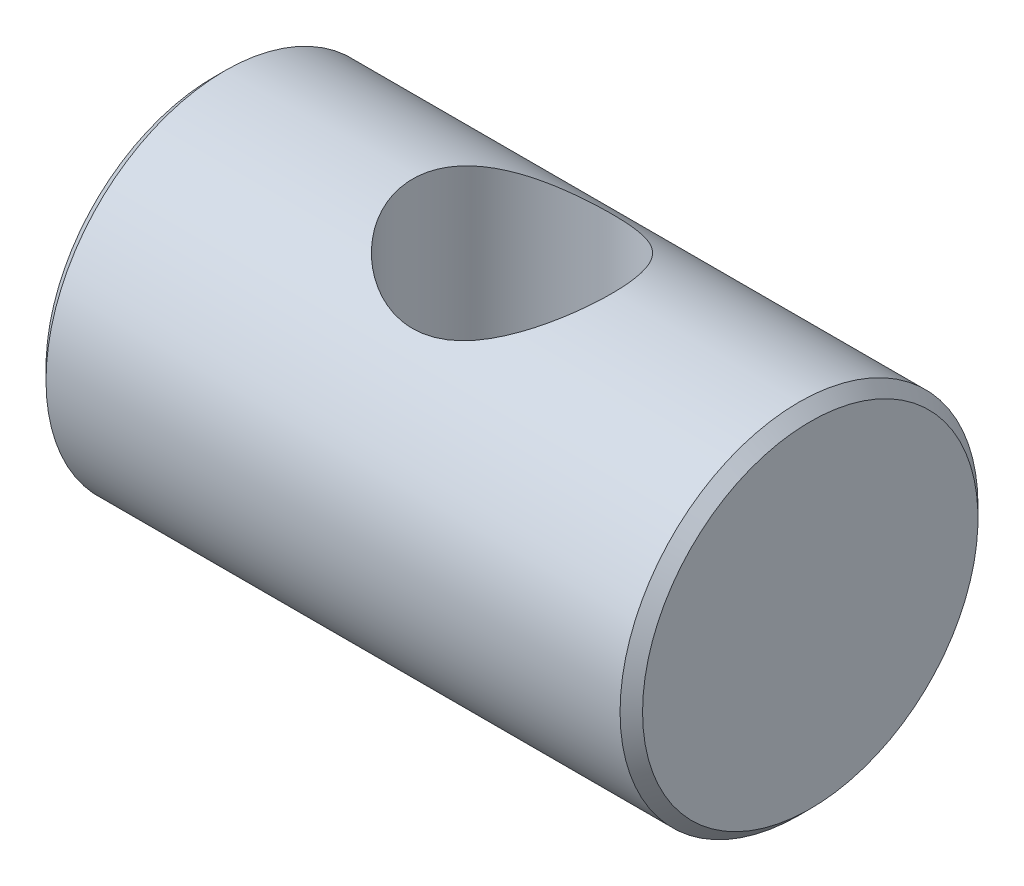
ISO-10303-21;
HEADER;
FILE_DESCRIPTION(('STEP AP214'),'2;1');
FILE_NAME('part.step','',(''),(''),'','','');
FILE_SCHEMA(('AUTOMOTIVE_DESIGN { 1 0 10303 214 1 1 1 1 }'));
ENDSEC;
DATA;
#1=APPLICATION_CONTEXT('core data for automotive mechanical design processes');
#2=APPLICATION_PROTOCOL_DEFINITION('international standard','automotive_design',2000,#1);
#3=PRODUCT_CONTEXT('',#1,'mechanical');
#4=PRODUCT('Part','Part','',(#3));
#5=PRODUCT_RELATED_PRODUCT_CATEGORY('part','',(#4));
#6=PRODUCT_DEFINITION_FORMATION('','',#4);
#7=PRODUCT_DEFINITION_CONTEXT('part definition',#1,'design');
#8=PRODUCT_DEFINITION('design','',#6,#7);
#9=PRODUCT_DEFINITION_SHAPE('','',#8);
#10=(LENGTH_UNIT() NAMED_UNIT(*) SI_UNIT(.MILLI.,.METRE.));
#11=(NAMED_UNIT(*) PLANE_ANGLE_UNIT() SI_UNIT($,.RADIAN.));
#12=(NAMED_UNIT(*) SI_UNIT($,.STERADIAN.) SOLID_ANGLE_UNIT());
#13=UNCERTAINTY_MEASURE_WITH_UNIT(LENGTH_MEASURE(1.E-05),#10,'distance_accuracy_value','');
#14=(GEOMETRIC_REPRESENTATION_CONTEXT(3) GLOBAL_UNCERTAINTY_ASSIGNED_CONTEXT((#13)) GLOBAL_UNIT_ASSIGNED_CONTEXT((#10,
#11,#12)) REPRESENTATION_CONTEXT('',''));
#15=CARTESIAN_POINT('',(0.,0.,0.));
#16=DIRECTION('',(0.,0.,1.));
#17=DIRECTION('',(1.,0.,0.));
#18=AXIS2_PLACEMENT_3D('',#15,#16,#17);
#19=CARTESIAN_POINT('',(7.5,4.21715728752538,0.));
#20=DIRECTION('',(-1.,0.,0.));
#21=DIRECTION('',(0.,0.,1.));
#22=AXIS2_PLACEMENT_3D('',#19,#20,#21);
#23=PLANE('',#22);
#24=CARTESIAN_POINT('',(7.49999999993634,0.,0.));
#25=DIRECTION('',(-1.,0.,0.));
#26=DIRECTION('',(0.,0.,1.));
#27=AXIS2_PLACEMENT_3D('',#24,#25,#26);
#28=CIRCLE('',#27,4.2171572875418);
#29=CARTESIAN_POINT('',(7.49999999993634,0.,4.2171572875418));
#30=VERTEX_POINT('',#29);
#31=EDGE_CURVE('E43',#30,#30,#28,.T.);
#32=ORIENTED_EDGE('',*,*,#31,.F.);
#33=EDGE_LOOP('',(#32));
#34=FACE_BOUND('',#33,.T.);
#35=ADVANCED_FACE('F12',(#34),#23,.F.);
#36=CARTESIAN_POINT('',(-7.5,0.,0.));
#37=DIRECTION('',(1.,0.,0.));
#38=DIRECTION('',(0.,0.,-1.));
#39=AXIS2_PLACEMENT_3D('',#36,#37,#38);
#40=PLANE('',#39);
#41=CARTESIAN_POINT('',(-7.49999999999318,0.,0.));
#42=DIRECTION('',(1.,0.,0.));
#43=DIRECTION('',(0.,0.,-1.));
#44=AXIS2_PLACEMENT_3D('',#41,#42,#43);
#45=CIRCLE('',#44,4.2171572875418);
#46=CARTESIAN_POINT('',(-7.49999999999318,0.,-4.2171572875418));
#47=VERTEX_POINT('',#46);
#48=EDGE_CURVE('E70',#47,#47,#45,.T.);
#49=ORIENTED_EDGE('',*,*,#48,.F.);
#50=EDGE_LOOP('',(#49));
#51=FACE_BOUND('',#50,.T.);
#52=ADVANCED_FACE('F59',(#51),#40,.F.);
#53=CARTESIAN_POINT('',(7.2171572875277,0.,0.));
#54=DIRECTION('',(-1.,0.,0.));
#55=DIRECTION('',(0.,0.,1.));
#56=AXIS2_PLACEMENT_3D('',#53,#54,#55);
#57=CONICAL_SURFACE('',#56,4.49999999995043,0.785398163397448);
#58=CARTESIAN_POINT('',(7.21715728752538,0.,0.));
#59=DIRECTION('',(1.,0.,0.));
#60=DIRECTION('',(0.,0.,-1.));
#61=AXIS2_PLACEMENT_3D('',#58,#59,#60);
#62=CIRCLE('',#61,4.5);
#63=CARTESIAN_POINT('',(7.21715728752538,0.,-4.5));
#64=VERTEX_POINT('',#63);
#65=EDGE_CURVE('E37',#64,#64,#62,.F.);
#66=ORIENTED_EDGE('',*,*,#65,.F.);
#67=EDGE_LOOP('',(#66));
#68=FACE_BOUND('',#67,.T.);
#69=ORIENTED_EDGE('',*,*,#31,.T.);
#70=EDGE_LOOP('',(#69));
#71=FACE_BOUND('',#70,.T.);
#72=ADVANCED_FACE('F64',(#68,#71),#57,.T.);
#73=CARTESIAN_POINT('',(-7.21715728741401,0.,0.));
#74=DIRECTION('',(1.,0.,0.));
#75=DIRECTION('',(0.,0.,-1.));
#76=AXIS2_PLACEMENT_3D('',#73,#74,#75);
#77=CONICAL_SURFACE('',#76,4.50000000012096,0.785398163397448);
#78=ORIENTED_EDGE('',*,*,#48,.T.);
#79=EDGE_LOOP('',(#78));
#80=FACE_BOUND('',#79,.T.);
#81=CARTESIAN_POINT('',(-7.21715728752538,0.,0.));
#82=DIRECTION('',(1.,0.,0.));
#83=DIRECTION('',(0.,0.,-1.));
#84=AXIS2_PLACEMENT_3D('',#81,#82,#83);
#85=CIRCLE('',#84,4.5);
#86=CARTESIAN_POINT('',(-7.21715728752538,0.,-4.5));
#87=VERTEX_POINT('',#86);
#88=EDGE_CURVE('E31',#87,#87,#85,.T.);
#89=ORIENTED_EDGE('',*,*,#88,.F.);
#90=EDGE_LOOP('',(#89));
#91=FACE_BOUND('',#90,.T.);
#92=ADVANCED_FACE('F56',(#80,#91),#77,.T.);
#93=CARTESIAN_POINT('',(7.5,0.,0.));
#94=DIRECTION('',(1.,0.,0.));
#95=DIRECTION('',(0.,0.,-1.));
#96=AXIS2_PLACEMENT_3D('',#93,#94,#95);
#97=CYLINDRICAL_SURFACE('',#96,4.5);
#98=CARTESIAN_POINT('',(2.5,-4.5,0.));
#99=CARTESIAN_POINT('',(2.5000036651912,-4.50000314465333,0.12975809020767));
#100=CARTESIAN_POINT('',(2.48985342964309,-4.49433969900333,0.259495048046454));
#101=CARTESIAN_POINT('',(2.44980813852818,-4.4722793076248,0.514936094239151));
#102=CARTESIAN_POINT('',(2.41990941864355,-4.45588036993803,0.640639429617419));
#103=CARTESIAN_POINT('',(2.34193984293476,-4.41402427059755,0.884087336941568));
#104=CARTESIAN_POINT('',(2.29393574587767,-4.3886004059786,1.0018592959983));
#105=CARTESIAN_POINT('',(2.18156833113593,-4.33092577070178,1.2274597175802));
#106=CARTESIAN_POINT('',(2.11720108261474,-4.29867335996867,1.33528578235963));
#107=CARTESIAN_POINT('',(1.96891331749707,-4.22753981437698,1.54633615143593));
#108=CARTESIAN_POINT('',(1.88394435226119,-4.18835368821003,1.64871905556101));
#109=CARTESIAN_POINT('',(1.69916733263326,-4.10855473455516,1.83858802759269));
#110=CARTESIAN_POINT('',(1.59934431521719,-4.06794050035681,1.92605888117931));
#111=CARTESIAN_POINT('',(1.37568478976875,-3.98505246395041,2.09257063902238));
#112=CARTESIAN_POINT('',(1.25043989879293,-3.94302761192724,2.1698588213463));
#113=CARTESIAN_POINT('',(0.986308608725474,-3.86741690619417,2.30193682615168));
#114=CARTESIAN_POINT('',(0.847442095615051,-3.83381899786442,2.35675885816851));
#115=CARTESIAN_POINT('',(0.589942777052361,-3.78623301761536,2.43228219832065));
#116=CARTESIAN_POINT('',(0.473190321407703,-3.76960776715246,2.4577327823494));
#117=CARTESIAN_POINT('',(0.236264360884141,-3.74726165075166,2.49167870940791));
#118=CARTESIAN_POINT('',(0.116094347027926,-3.74153003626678,2.50019076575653));
#119=CARTESIAN_POINT('',(-0.12433109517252,-3.74178926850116,2.49980245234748));
#120=CARTESIAN_POINT('',(-0.244586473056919,-3.74779295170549,2.49088301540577));
#121=CARTESIAN_POINT('',(-0.481577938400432,-3.77067196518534,2.45610447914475));
#122=CARTESIAN_POINT('',(-0.598311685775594,-3.78755436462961,2.43023436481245));
#123=CARTESIAN_POINT('',(-0.825432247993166,-3.82999424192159,2.36277650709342));
#124=CARTESIAN_POINT('',(-0.935817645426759,-3.85555364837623,2.32118526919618));
#125=CARTESIAN_POINT('',(-1.14840752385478,-3.91258606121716,2.22370256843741));
#126=CARTESIAN_POINT('',(-1.25060878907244,-3.9440613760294,2.16780552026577));
#127=CARTESIAN_POINT('',(-1.46041329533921,-4.01517496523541,2.03346434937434));
#128=CARTESIAN_POINT('',(-1.56647725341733,-4.05532685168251,1.95288470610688));
#129=CARTESIAN_POINT('',(-1.76453695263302,-4.13586693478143,1.77596825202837));
#130=CARTESIAN_POINT('',(-1.85652147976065,-4.17625529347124,1.67961900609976));
#131=CARTESIAN_POINT('',(-2.0331489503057,-4.25757409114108,1.4621390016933));
#132=CARTESIAN_POINT('',(-2.11610219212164,-4.29814437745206,1.33948616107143));
#133=CARTESIAN_POINT('',(-2.25981054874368,-4.37068555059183,1.07947802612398));
#134=CARTESIAN_POINT('',(-2.3205802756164,-4.40266209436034,0.942132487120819));
#135=CARTESIAN_POINT('',(-2.41351083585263,-4.45237093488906,0.666748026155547));
#136=CARTESIAN_POINT('',(-2.44739476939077,-4.4709525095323,0.529448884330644));
#137=CARTESIAN_POINT('',(-2.49147370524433,-4.49522961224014,0.250024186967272));
#138=CARTESIAN_POINT('',(-2.5016896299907,-4.50093652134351,0.107903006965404));
#139=CARTESIAN_POINT('',(-2.4980667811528,-4.49892791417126,-0.159736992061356));
#140=CARTESIAN_POINT('',(-2.48682325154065,-4.49266045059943,-0.285311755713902));
#141=CARTESIAN_POINT('',(-2.44584814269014,-4.4701096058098,-0.532461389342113));
#142=CARTESIAN_POINT('',(-2.41611596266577,-4.45382589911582,-0.654036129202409));
#143=CARTESIAN_POINT('',(-2.33962868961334,-4.41280294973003,-0.889626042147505));
#144=CARTESIAN_POINT('',(-2.29293635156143,-4.38809489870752,-1.00366727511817));
#145=CARTESIAN_POINT('',(-2.18417381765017,-4.33225575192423,-1.22242448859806));
#146=CARTESIAN_POINT('',(-2.12209950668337,-4.30112293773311,-1.32713796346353));
#147=CARTESIAN_POINT('',(-1.97708780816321,-4.23136184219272,-1.53587082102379));
#148=CARTESIAN_POINT('',(-1.89265924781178,-4.19229170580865,-1.63870553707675));
#149=CARTESIAN_POINT('',(-1.70890692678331,-4.1126031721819,-1.82953913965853));
#150=CARTESIAN_POINT('',(-1.6095667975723,-4.07198311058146,-1.91752149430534));
#151=CARTESIAN_POINT('',(-1.38693835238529,-3.98896862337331,-2.08511961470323));
#152=CARTESIAN_POINT('',(-1.26224573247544,-3.94680755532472,-2.16300015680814));
#153=CARTESIAN_POINT('',(-0.999155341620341,-3.87073262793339,-2.29637932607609));
#154=CARTESIAN_POINT('',(-0.860777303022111,-3.83680713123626,-2.3519096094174));
#155=CARTESIAN_POINT('',(-0.603783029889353,-3.78841904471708,-2.42888889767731));
#156=CARTESIAN_POINT('',(-0.487058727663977,-3.77137372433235,-2.45502886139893));
#157=CARTESIAN_POINT('',(-0.250053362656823,-3.74815645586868,-2.49033925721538));
#158=CARTESIAN_POINT('',(-0.129775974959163,-3.74197364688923,-2.49952663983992));
#159=CARTESIAN_POINT('',(0.111021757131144,-3.74136462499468,-2.50043819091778));
#160=CARTESIAN_POINT('',(0.231542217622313,-3.74695304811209,-2.49214061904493));
#161=CARTESIAN_POINT('',(0.469167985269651,-3.76909609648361,-2.45851643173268));
#162=CARTESIAN_POINT('',(0.586271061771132,-3.78565772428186,-2.4331789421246));
#163=CARTESIAN_POINT('',(0.813818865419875,-3.82750534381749,-2.36679483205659));
#164=CARTESIAN_POINT('',(0.924282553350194,-3.85276495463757,-2.32579567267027));
#165=CARTESIAN_POINT('',(1.13710828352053,-3.90927937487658,-2.2294944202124));
#166=CARTESIAN_POINT('',(1.23946718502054,-3.94053649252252,-2.17418681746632));
#167=CARTESIAN_POINT('',(1.44956229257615,-4.01123588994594,-2.04119262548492));
#168=CARTESIAN_POINT('',(1.55578441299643,-4.05120181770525,-1.96138962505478));
#169=CARTESIAN_POINT('',(1.75429511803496,-4.13150106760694,-1.7860593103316));
#170=CARTESIAN_POINT('',(1.84657233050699,-4.17183466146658,-1.6905192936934));
#171=CARTESIAN_POINT('',(2.02421264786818,-4.25330121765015,-1.47447866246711));
#172=CARTESIAN_POINT('',(2.10785564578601,-4.29408020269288,-1.35241492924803));
#173=CARTESIAN_POINT('',(2.25305506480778,-4.36718657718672,-1.09349141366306));
#174=CARTESIAN_POINT('',(2.31462759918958,-4.3995201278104,-0.956642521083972));
#175=CARTESIAN_POINT('',(2.40827143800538,-4.44953408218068,-0.684823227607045));
#176=CARTESIAN_POINT('',(2.44250264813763,-4.46827306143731,-0.550796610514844));
#177=CARTESIAN_POINT('',(2.48835611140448,-4.49349953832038,-0.277835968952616));
#178=CARTESIAN_POINT('',(2.49999607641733,-4.49999663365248,-0.138905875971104));
#179=CARTESIAN_POINT('',(2.5,-4.5,0.));
#180=B_SPLINE_CURVE_WITH_KNOTS('',3,(#98,#99,#100,#101,#102,#103,#104,#105,#106,#107,#108,#109,
#110,#111,#112,#113,#114,#115,#116,#117,#118,#119,#120,#121,#122,#123,#124,#125,#126,#127,#128,
#129,#130,#131,#132,#133,#134,#135,#136,#137,#138,#139,#140,#141,#142,#143,#144,#145,#146,#147,
#148,#149,#150,#151,#152,#153,#154,#155,#156,#157,#158,#159,#160,#161,#162,#163,#164,#165,#166,
#167,#168,#169,#170,#171,#172,#173,#174,#175,#176,#177,#178,#179),.UNSPECIFIED.,.T.,.F.,(4,2,2,
2,2,2,2,2,2,2,2,2,2,2,2,2,2,2,2,2,2,2,2,2,2,2,2,2,2,2,2,2,2,2,2,2,2,2,2,2,4),(0.,
0.388735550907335,0.777543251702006,1.16493112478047,1.55241214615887,1.96683794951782,
2.38168408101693,2.83857267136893,3.29480391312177,3.65516176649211,4.01516387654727,
4.37555999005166,4.73619053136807,5.09690128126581,5.45775307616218,5.87344204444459,
6.2894603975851,6.74765475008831,7.20554674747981,7.63096944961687,8.05601593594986,
8.43288535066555,8.80976701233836,9.18526813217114,9.56086981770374,9.97519675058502,
10.389981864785,10.846544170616,11.3024575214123,11.6633530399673,12.0238875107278,
12.3848705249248,12.7460841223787,13.1062116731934,13.466478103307,13.8810342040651,
14.2959265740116,14.7540149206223,15.2117681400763,15.6282357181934,16.0443766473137),.UNSPECIFIED.);
#181=CARTESIAN_POINT('',(2.5,-4.5,0.));
#182=VERTEX_POINT('',#181);
#183=EDGE_CURVE('E8',#182,#182,#180,.T.);
#184=ORIENTED_EDGE('',*,*,#183,.F.);
#185=EDGE_LOOP('',(#184));
#186=FACE_BOUND('',#185,.T.);
#187=CARTESIAN_POINT('',(0.,3.74165738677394,2.5));
#188=CARTESIAN_POINT('',(0.127867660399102,3.7416726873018,2.4999886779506));
#189=CARTESIAN_POINT('',(0.255847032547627,3.74831704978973,2.49012046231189));
#190=CARTESIAN_POINT('',(0.507679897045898,3.77384839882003,2.45123834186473));
#191=CARTESIAN_POINT('',(0.631526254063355,3.79275551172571,2.42219296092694));
#192=CARTESIAN_POINT('',(0.870945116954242,3.83989933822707,2.34672518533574));
#193=CARTESIAN_POINT('',(0.986564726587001,3.86807667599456,2.30041313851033));
#194=CARTESIAN_POINT('',(1.20834600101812,3.93048941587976,2.19206578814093));
#195=CARTESIAN_POINT('',(1.31450555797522,3.96472616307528,2.13002699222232));
#196=CARTESIAN_POINT('',(1.52641671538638,4.03969403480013,1.98449846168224));
#197=CARTESIAN_POINT('',(1.63099357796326,4.08073069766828,1.89945493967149));
#198=CARTESIAN_POINT('',(1.82534633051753,4.16222299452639,1.71353751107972));
#199=CARTESIAN_POINT('',(1.91511315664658,4.20267825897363,1.61265398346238));
#200=CARTESIAN_POINT('',(2.08508983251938,4.28269640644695,1.3870985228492));
#201=CARTESIAN_POINT('',(2.1637603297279,4.32186646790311,1.26111369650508));
#202=CARTESIAN_POINT('',(2.29824166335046,4.39073714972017,0.995108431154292));
#203=CARTESIAN_POINT('',(2.35407027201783,4.4204451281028,0.85509901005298));
#204=CARTESIAN_POINT('',(2.43630568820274,4.46480622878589,0.577542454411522));
#205=CARTESIAN_POINT('',(2.46480060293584,4.48051966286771,0.440787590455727));
#206=CARTESIAN_POINT('',(2.49853448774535,4.49916269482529,0.163616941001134));
#207=CARTESIAN_POINT('',(2.50379152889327,4.50210222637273,0.0232040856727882));
#208=CARTESIAN_POINT('',(2.4914765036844,4.4952695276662,-0.241178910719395));
#209=CARTESIAN_POINT('',(2.47628215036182,4.48682112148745,-0.365303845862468));
#210=CARTESIAN_POINT('',(2.42789099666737,4.46029652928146,-0.608906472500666));
#211=CARTESIAN_POINT('',(2.39469280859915,4.44221960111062,-0.728383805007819));
#212=CARTESIAN_POINT('',(2.31126649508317,4.39780601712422,-0.96097965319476));
#213=CARTESIAN_POINT('',(2.26086630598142,4.3713861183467,-1.07401990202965));
#214=CARTESIAN_POINT('',(2.14483738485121,4.31251997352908,-1.29025059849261));
#215=CARTESIAN_POINT('',(2.07920386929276,4.28007183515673,-1.39343793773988));
#216=CARTESIAN_POINT('',(1.92640653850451,4.20785286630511,-1.59909620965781));
#217=CARTESIAN_POINT('',(1.83767397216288,4.16766932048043,-1.70025747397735));
#218=CARTESIAN_POINT('',(1.64533173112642,4.08650106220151,-1.88703556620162));
#219=CARTESIAN_POINT('',(1.54170632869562,4.04551554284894,-1.97263574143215));
#220=CARTESIAN_POINT('',(1.31107929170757,3.96312397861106,-2.13367090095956));
#221=CARTESIAN_POINT('',(1.1828097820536,3.92201714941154,-2.2074790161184));
#222=CARTESIAN_POINT('',(0.980669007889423,3.86749177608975,-2.30082855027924));
#223=CARTESIAN_POINT('',(0.911652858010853,3.8505034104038,-2.32905476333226));
#224=CARTESIAN_POINT('',(0.770776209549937,3.81960529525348,-2.3793879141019));
#225=CARTESIAN_POINT('',(0.698917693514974,3.80569344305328,-2.4014990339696));
#226=CARTESIAN_POINT('',(0.558744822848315,3.7825660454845,-2.43774893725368));
#227=CARTESIAN_POINT('',(0.490605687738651,3.77306418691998,-2.45238335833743));
#228=CARTESIAN_POINT('',(0.352979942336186,3.75764870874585,-2.47593920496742));
#229=CARTESIAN_POINT('',(0.283494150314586,3.75173297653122,-2.48486399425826));
#230=CARTESIAN_POINT('',(0.143844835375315,3.7437735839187,-2.49684067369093));
#231=CARTESIAN_POINT('',(0.0736818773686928,3.74172693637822,-2.49989709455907));
#232=CARTESIAN_POINT('',(-0.0666321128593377,3.74159115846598,-2.5000979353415));
#233=CARTESIAN_POINT('',(-0.136783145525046,3.74350157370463,-2.49724303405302));
#234=CARTESIAN_POINT('',(-0.32521266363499,3.75390669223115,-2.48160454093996));
#235=CARTESIAN_POINT('',(-0.442885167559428,3.7660681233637,-2.46327912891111));
#236=CARTESIAN_POINT('',(-0.673061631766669,3.79999671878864,-2.41059641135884));
#237=CARTESIAN_POINT('',(-0.785563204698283,3.8217682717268,-2.37623178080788));
#238=CARTESIAN_POINT('',(-1.00774180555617,3.8734200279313,-2.29111009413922));
#239=CARTESIAN_POINT('',(-1.11711092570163,3.90359765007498,-2.23973536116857));
#240=CARTESIAN_POINT('',(-1.32632576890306,3.96852930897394,-2.12255957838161));
#241=CARTESIAN_POINT('',(-1.42616680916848,4.00328557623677,-2.05675148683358));
#242=CARTESIAN_POINT('',(-1.63049062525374,4.08021308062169,-1.90016864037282));
#243=CARTESIAN_POINT('',(-1.73309682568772,4.12267224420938,-1.80707526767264));
#244=CARTESIAN_POINT('',(-1.92199935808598,4.20557655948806,-1.60470900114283));
#245=CARTESIAN_POINT('',(-2.00828561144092,4.24602045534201,-1.49542618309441));
#246=CARTESIAN_POINT('',(-2.16643294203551,4.32300875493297,-1.25626042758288));
#247=CARTESIAN_POINT('',(-2.23726807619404,4.3592262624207,-1.12558547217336));
#248=CARTESIAN_POINT('',(-2.35519631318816,4.42090637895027,-0.851602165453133));
#249=CARTESIAN_POINT('',(-2.40231447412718,4.44638033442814,-0.708307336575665));
#250=CARTESIAN_POINT('',(-2.46664777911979,4.48148519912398,-0.428990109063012));
#251=CARTESIAN_POINT('',(-2.48643742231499,4.49247473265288,-0.29373267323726));
#252=CARTESIAN_POINT('',(-2.50362240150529,4.5020067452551,-0.0213910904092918));
#253=CARTESIAN_POINT('',(-2.50103007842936,4.50055608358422,0.115692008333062));
#254=CARTESIAN_POINT('',(-2.47491437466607,4.48610175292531,0.374337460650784));
#255=CARTESIAN_POINT('',(-2.45334235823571,4.47417531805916,0.496165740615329));
#256=CARTESIAN_POINT('',(-2.39292228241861,4.44133257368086,0.734167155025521));
#257=CARTESIAN_POINT('',(-2.3540722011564,4.42041521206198,0.850339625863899));
#258=CARTESIAN_POINT('',(-2.25905612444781,4.3705432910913,1.07814775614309));
#259=CARTESIAN_POINT('',(-2.202363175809,4.34134725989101,1.18950897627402));
#260=CARTESIAN_POINT('',(-2.07393542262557,4.27762772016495,1.40148896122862));
#261=CARTESIAN_POINT('',(-2.00219469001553,4.24310211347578,1.50210346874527));
#262=CARTESIAN_POINT('',(-1.83613517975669,4.16717195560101,1.70217916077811));
#263=CARTESIAN_POINT('',(-1.74016022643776,4.12543450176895,1.8001424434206));
#264=CARTESIAN_POINT('',(-1.53330418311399,4.04252541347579,1.97933250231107));
#265=CARTESIAN_POINT('',(-1.42240466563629,4.0013545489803,2.06053826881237));
#266=CARTESIAN_POINT('',(-1.17899936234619,3.92122408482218,2.20944802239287));
#267=CARTESIAN_POINT('',(-1.04552040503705,3.88262653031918,2.27579178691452));
#268=CARTESIAN_POINT('',(-0.836526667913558,3.83343009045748,2.35707752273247));
#269=CARTESIAN_POINT('',(-0.765460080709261,3.81848976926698,2.38112244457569));
#270=CARTESIAN_POINT('',(-0.620861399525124,3.79215325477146,2.4228459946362));
#271=CARTESIAN_POINT('',(-0.547330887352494,3.78075483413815,2.44052862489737));
#272=CARTESIAN_POINT('',(-0.395409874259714,3.76170841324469,2.4697920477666));
#273=CARTESIAN_POINT('',(-0.316943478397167,3.75423236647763,2.48109451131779));
#274=CARTESIAN_POINT('',(-0.158999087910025,3.74420222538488,2.49620181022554));
#275=CARTESIAN_POINT('',(-0.0795211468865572,3.74164787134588,2.50000704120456));
#276=CARTESIAN_POINT('',(0.,3.74165738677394,2.5));
#277=B_SPLINE_CURVE_WITH_KNOTS('',3,(#187,#188,#189,#190,#191,#192,#193,#194,#195,#196,#197,
#198,#199,#200,#201,#202,#203,#204,#205,#206,#207,#208,#209,#210,#211,#212,#213,#214,#215,#216,
#217,#218,#219,#220,#221,#222,#223,#224,#225,#226,#227,#228,#229,#230,#231,#232,#233,#234,#235,
#236,#237,#238,#239,#240,#241,#242,#243,#244,#245,#246,#247,#248,#249,#250,#251,#252,#253,#254,
#255,#256,#257,#258,#259,#260,#261,#262,#263,#264,#265,#266,#267,#268,#269,#270,#271,#272,#273,
#274,#275,#276),.UNSPECIFIED.,.T.,.F.,(4,2,2,2,2,2,2,2,2,2,2,2,2,2,2,2,2,2,2,2,2,2,2,2,2,2,2,2,
2,2,2,2,2,2,2,2,2,2,2,2,2,2,2,2,4),(0.,0.383275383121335,0.767181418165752,1.14867490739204,
1.53025318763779,1.95124472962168,2.37249297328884,2.8308639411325,3.2888775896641,
3.70817544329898,4.12714717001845,4.50138183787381,4.8756453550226,5.25376784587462,
5.63200923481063,6.05157027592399,6.47157769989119,6.92969119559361,7.15882945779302,
7.38781062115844,7.59850621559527,7.80907756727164,8.01948627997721,8.22987083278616,
8.58719279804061,8.94467811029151,9.31690871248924,9.68932132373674,10.122176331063,
10.5552977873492,11.0117233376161,11.4676656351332,11.8767730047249,12.2856548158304,
12.6568475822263,13.0280837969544,13.4115163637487,13.7951002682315,14.2233400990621,
14.6521136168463,15.1111969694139,15.3403711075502,15.5694008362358,15.80777312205,
16.0461328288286),.UNSPECIFIED.);
#278=CARTESIAN_POINT('',(0.,3.74165738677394,2.5));
#279=VERTEX_POINT('',#278);
#280=EDGE_CURVE('E24',#279,#279,#277,.T.);
#281=ORIENTED_EDGE('',*,*,#280,.F.);
#282=EDGE_LOOP('',(#281));
#283=FACE_BOUND('',#282,.T.);
#284=ORIENTED_EDGE('',*,*,#88,.T.);
#285=EDGE_LOOP('',(#284));
#286=FACE_BOUND('',#285,.T.);
#287=ORIENTED_EDGE('',*,*,#65,.T.);
#288=EDGE_LOOP('',(#287));
#289=FACE_BOUND('',#288,.T.);
#290=ADVANCED_FACE('F45',(#186,#283,#286,#289),#97,.T.);
#291=CARTESIAN_POINT('',(0.,-4.5,0.));
#292=DIRECTION('',(0.,1.,0.));
#293=DIRECTION('',(0.,0.,1.));
#294=AXIS2_PLACEMENT_3D('',#291,#292,#293);
#295=CYLINDRICAL_SURFACE('',#294,2.5);
#296=ORIENTED_EDGE('',*,*,#183,.T.);
#297=EDGE_LOOP('',(#296));
#298=FACE_BOUND('',#297,.T.);
#299=ORIENTED_EDGE('',*,*,#280,.T.);
#300=EDGE_LOOP('',(#299));
#301=FACE_BOUND('',#300,.T.);
#302=ADVANCED_FACE('F48',(#298,#301),#295,.F.);
#303=CLOSED_SHELL('',(#35,#52,#72,#92,#290,#302));
#304=MANIFOLD_SOLID_BREP('B1',#303);
#305=ADVANCED_BREP_SHAPE_REPRESENTATION('',(#18,#304),#14);
#306=SHAPE_DEFINITION_REPRESENTATION(#9,#305);
ENDSEC;
END-ISO-10303-21;
